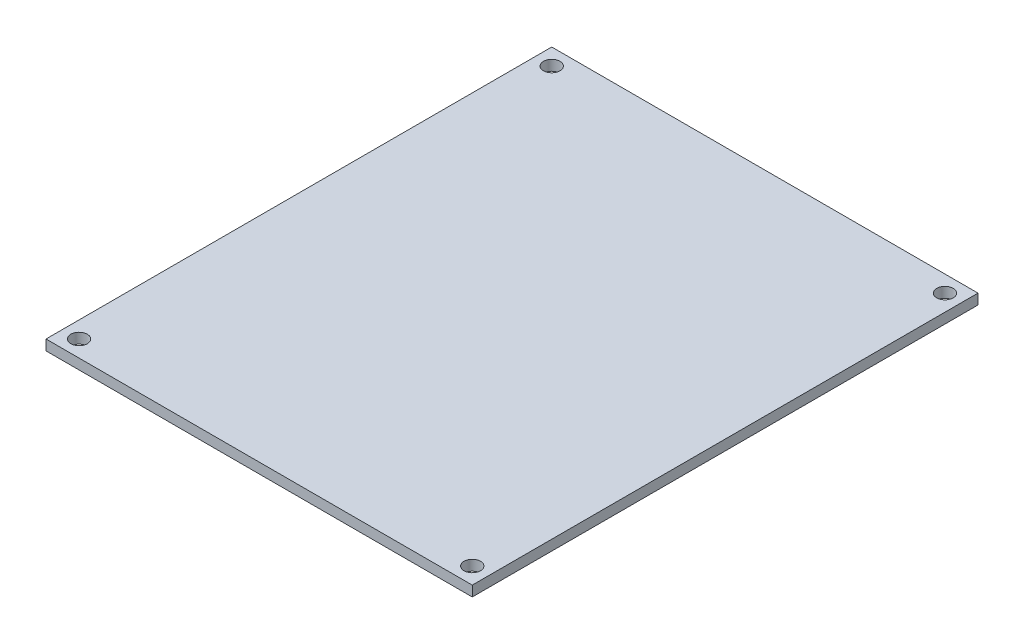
from build123d import *

# Parameters (mm, degrees)
SKETCH1_W                  = 82.6
SKETCH1_H                  = 98
BOSS_EXTRUDE1_DEPTH        = 2
F_3_2_3_2_DIAMETER_HOLE1_D = 3.2


with BuildPart() as part:
    # Sketch1 → Boss-Extrude1 (new body)
    with BuildSketch(Plane(origin=(0, 0, 0), x_dir=(1, 0, 0), z_dir=(0, 1, 0))):
        Rectangle(SKETCH1_W, SKETCH1_H)
    extrude(amount=BOSS_EXTRUDE1_DEPTH)

    # 3.2 _3.2_ Diameter Hole1 (through all)
    with Locations(Plane(origin=(0, 2, 0), x_dir=(1, 0, 0), z_dir=(0, 1, 0))):
        with Locations((-38.1, 45.8), (38.1, 45.8), (38.1, -45.8), (-38.1, -45.8)):
            Hole(F_3_2_3_2_DIAMETER_HOLE1_D / 2)


solid = part.part
